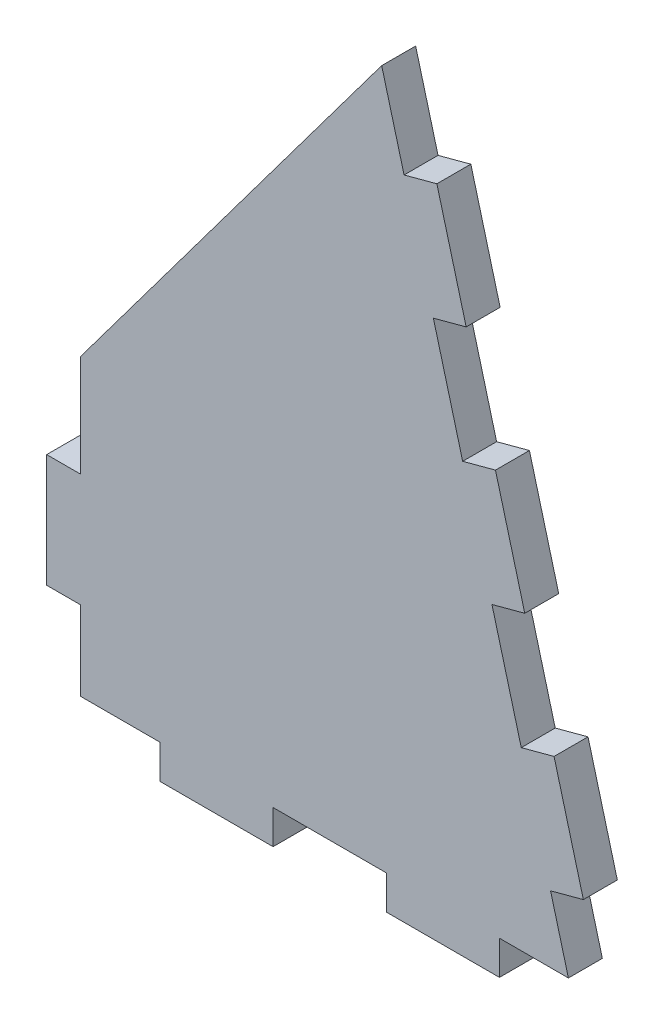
ISO-10303-21;
HEADER;
FILE_DESCRIPTION(('STEP AP214'),'2;1');
FILE_NAME('part.step','',(''),(''),'','','');
FILE_SCHEMA(('AUTOMOTIVE_DESIGN { 1 0 10303 214 1 1 1 1 }'));
ENDSEC;
DATA;
#1=APPLICATION_CONTEXT('core data for automotive mechanical design processes');
#2=APPLICATION_PROTOCOL_DEFINITION('international standard','automotive_design',2000,#1);
#3=PRODUCT_CONTEXT('',#1,'mechanical');
#4=PRODUCT('Part','Part','',(#3));
#5=PRODUCT_RELATED_PRODUCT_CATEGORY('part','',(#4));
#6=PRODUCT_DEFINITION_FORMATION('','',#4);
#7=PRODUCT_DEFINITION_CONTEXT('part definition',#1,'design');
#8=PRODUCT_DEFINITION('design','',#6,#7);
#9=PRODUCT_DEFINITION_SHAPE('','',#8);
#10=(LENGTH_UNIT() NAMED_UNIT(*) SI_UNIT(.MILLI.,.METRE.));
#11=(NAMED_UNIT(*) PLANE_ANGLE_UNIT() SI_UNIT($,.RADIAN.));
#12=(NAMED_UNIT(*) SI_UNIT($,.STERADIAN.) SOLID_ANGLE_UNIT());
#13=UNCERTAINTY_MEASURE_WITH_UNIT(LENGTH_MEASURE(1.E-05),#10,'distance_accuracy_value','');
#14=(GEOMETRIC_REPRESENTATION_CONTEXT(3) GLOBAL_UNCERTAINTY_ASSIGNED_CONTEXT((#13)) GLOBAL_UNIT_ASSIGNED_CONTEXT((#10,
#11,#12)) REPRESENTATION_CONTEXT('',''));
#15=CARTESIAN_POINT('',(0.,0.,0.));
#16=DIRECTION('',(0.,0.,1.));
#17=DIRECTION('',(1.,0.,0.));
#18=AXIS2_PLACEMENT_3D('',#15,#16,#17);
#19=CARTESIAN_POINT('',(0.,0.,-3.));
#20=DIRECTION('',(0.,-1.,0.));
#21=DIRECTION('',(0.,0.,-1.));
#22=AXIS2_PLACEMENT_3D('',#19,#20,#21);
#23=PLANE('',#22);
#24=DIRECTION('',(0.,0.,1.));
#25=VECTOR('',#24,1.);
#26=CARTESIAN_POINT('',(20.,0.,-3.));
#27=LINE('',#26,#25);
#28=CARTESIAN_POINT('',(20.,0.,-3.));
#29=VERTEX_POINT('',#28);
#30=CARTESIAN_POINT('',(20.,0.,0.));
#31=VERTEX_POINT('',#30);
#32=EDGE_CURVE('E378',#29,#31,#27,.T.);
#33=ORIENTED_EDGE('',*,*,#32,.T.);
#34=DIRECTION('',(1.,0.,0.));
#35=VECTOR('',#34,1.);
#36=CARTESIAN_POINT('',(0.,0.,0.));
#37=LINE('',#36,#35);
#38=CARTESIAN_POINT('',(10.,0.,0.));
#39=VERTEX_POINT('',#38);
#40=EDGE_CURVE('E260',#39,#31,#37,.T.);
#41=ORIENTED_EDGE('',*,*,#40,.F.);
#42=DIRECTION('',(0.,0.,1.));
#43=VECTOR('',#42,1.);
#44=CARTESIAN_POINT('',(10.,0.,-3.));
#45=LINE('',#44,#43);
#46=CARTESIAN_POINT('',(10.,0.,-3.));
#47=VERTEX_POINT('',#46);
#48=EDGE_CURVE('E405',#47,#39,#45,.T.);
#49=ORIENTED_EDGE('',*,*,#48,.F.);
#50=DIRECTION('',(1.,0.,0.));
#51=VECTOR('',#50,1.);
#52=CARTESIAN_POINT('',(0.,0.,-3.));
#53=LINE('',#52,#51);
#54=EDGE_CURVE('E240',#47,#29,#53,.T.);
#55=ORIENTED_EDGE('',*,*,#54,.T.);
#56=EDGE_LOOP('',(#33,#41,#49,#55));
#57=FACE_BOUND('',#56,.T.);
#58=ADVANCED_FACE('F32',(#57),#23,.T.);
#59=CARTESIAN_POINT('',(50.,0.,-3.));
#60=DIRECTION('',(0.965925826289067,0.258819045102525,0.));
#61=DIRECTION('',(-0.258819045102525,0.965925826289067,0.));
#62=AXIS2_PLACEMENT_3D('',#59,#60,#61);
#63=PLANE('',#62);
#64=DIRECTION('',(0.,0.,1.));
#65=VECTOR('',#64,1.);
#66=CARTESIAN_POINT('',(37.0590477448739,48.2962913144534,-3.));
#67=LINE('',#66,#65);
#68=CARTESIAN_POINT('',(37.0590477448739,48.2962913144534,-3.));
#69=VERTEX_POINT('',#68);
#70=CARTESIAN_POINT('',(37.0590477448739,48.2962913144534,0.));
#71=VERTEX_POINT('',#70);
#72=EDGE_CURVE('E308',#69,#71,#67,.T.);
#73=ORIENTED_EDGE('',*,*,#72,.F.);
#74=DIRECTION('',(-0.258819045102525,0.965925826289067,0.));
#75=VECTOR('',#74,1.);
#76=CARTESIAN_POINT('',(50.,0.,-3.));
#77=LINE('',#76,#75);
#78=CARTESIAN_POINT('',(34.4708572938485,57.955549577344,-3.));
#79=VERTEX_POINT('',#78);
#80=EDGE_CURVE('E250',#69,#79,#77,.T.);
#81=ORIENTED_EDGE('',*,*,#80,.T.);
#82=DIRECTION('',(0.,0.,1.));
#83=VECTOR('',#82,1.);
#84=CARTESIAN_POINT('',(34.4708572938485,57.955549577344,-3.));
#85=LINE('',#84,#83);
#86=CARTESIAN_POINT('',(34.4708572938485,57.955549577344,0.));
#87=VERTEX_POINT('',#86);
#88=EDGE_CURVE('E309',#79,#87,#85,.T.);
#89=ORIENTED_EDGE('',*,*,#88,.T.);
#90=DIRECTION('',(-0.258819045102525,0.965925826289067,0.));
#91=VECTOR('',#90,1.);
#92=CARTESIAN_POINT('',(50.,0.,0.));
#93=LINE('',#92,#91);
#94=EDGE_CURVE('E263',#71,#87,#93,.T.);
#95=ORIENTED_EDGE('',*,*,#94,.F.);
#96=EDGE_LOOP('',(#73,#81,#89,#95));
#97=FACE_BOUND('',#96,.T.);
#98=ADVANCED_FACE('F327',(#97),#63,.T.);
#99=DIRECTION('',(0.,0.,1.));
#100=VECTOR('',#99,1.);
#101=CARTESIAN_POINT('',(39.6472381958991,38.6370330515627,-3.));
#102=LINE('',#101,#100);
#103=CARTESIAN_POINT('',(39.6472381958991,38.6370330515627,-3.));
#104=VERTEX_POINT('',#103);
#105=CARTESIAN_POINT('',(39.6472381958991,38.6370330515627,0.));
#106=VERTEX_POINT('',#105);
#107=EDGE_CURVE('E429',#104,#106,#102,.T.);
#108=ORIENTED_EDGE('',*,*,#107,.T.);
#109=CARTESIAN_POINT('',(42.2354286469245,28.9777747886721,0.));
#110=VERTEX_POINT('',#109);
#111=EDGE_CURVE('E264',#110,#106,#93,.T.);
#112=ORIENTED_EDGE('',*,*,#111,.F.);
#113=DIRECTION('',(0.,0.,1.));
#114=VECTOR('',#113,1.);
#115=CARTESIAN_POINT('',(42.2354286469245,28.9777747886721,-3.));
#116=LINE('',#115,#114);
#117=CARTESIAN_POINT('',(42.2354286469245,28.9777747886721,-3.));
#118=VERTEX_POINT('',#117);
#119=EDGE_CURVE('E424',#118,#110,#116,.T.);
#120=ORIENTED_EDGE('',*,*,#119,.F.);
#121=EDGE_CURVE('E252',#118,#104,#77,.T.);
#122=ORIENTED_EDGE('',*,*,#121,.T.);
#123=EDGE_LOOP('',(#108,#112,#120,#122));
#124=FACE_BOUND('',#123,.T.);
#125=ADVANCED_FACE('F481',(#124),#63,.T.);
#126=CARTESIAN_POINT('',(0.,0.,-3.));
#127=DIRECTION('',(-1.,0.,0.));
#128=DIRECTION('',(0.,0.,1.));
#129=AXIS2_PLACEMENT_3D('',#126,#127,#128);
#130=PLANE('',#129);
#131=DIRECTION('',(0.,0.,1.));
#132=VECTOR('',#131,1.);
#133=CARTESIAN_POINT('',(0.,20.,-3.));
#134=LINE('',#133,#132);
#135=CARTESIAN_POINT('',(0.,20.,-3.));
#136=VERTEX_POINT('',#135);
#137=CARTESIAN_POINT('',(0.,20.,0.));
#138=VERTEX_POINT('',#137);
#139=EDGE_CURVE('E47',#136,#138,#134,.T.);
#140=ORIENTED_EDGE('',*,*,#139,.F.);
#141=DIRECTION('',(0.,-1.,0.));
#142=VECTOR('',#141,1.);
#143=CARTESIAN_POINT('',(0.,0.,-3.));
#144=LINE('',#143,#142);
#145=CARTESIAN_POINT('',(0.,10.,-3.));
#146=VERTEX_POINT('',#145);
#147=EDGE_CURVE('E228',#136,#146,#144,.T.);
#148=ORIENTED_EDGE('',*,*,#147,.T.);
#149=DIRECTION('',(0.,0.,1.));
#150=VECTOR('',#149,1.);
#151=CARTESIAN_POINT('',(0.,10.,-3.));
#152=LINE('',#151,#150);
#153=CARTESIAN_POINT('',(0.,10.,0.));
#154=VERTEX_POINT('',#153);
#155=EDGE_CURVE('E354',#146,#154,#152,.T.);
#156=ORIENTED_EDGE('',*,*,#155,.T.);
#157=DIRECTION('',(0.,-1.,0.));
#158=VECTOR('',#157,1.);
#159=CARTESIAN_POINT('',(0.,0.,0.));
#160=LINE('',#159,#158);
#161=EDGE_CURVE('E230',#138,#154,#160,.T.);
#162=ORIENTED_EDGE('',*,*,#161,.F.);
#163=EDGE_LOOP('',(#140,#148,#156,#162));
#164=FACE_BOUND('',#163,.T.);
#165=ADVANCED_FACE('F34',(#164),#130,.T.);
#166=CARTESIAN_POINT('',(31.8826668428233,67.6148078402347,-3.));
#167=DIRECTION('',(-0.800706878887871,0.599056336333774,0.));
#168=DIRECTION('',(-0.599056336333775,-0.800706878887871,0.));
#169=AXIS2_PLACEMENT_3D('',#166,#167,#168);
#170=PLANE('',#169);
#171=DIRECTION('',(0.,0.,-1.));
#172=VECTOR('',#171,1.);
#173=CARTESIAN_POINT('',(2.99999999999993,29.0098409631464,-3.));
#174=LINE('',#173,#172);
#175=CARTESIAN_POINT('',(2.99999999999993,29.0098409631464,0.));
#176=VERTEX_POINT('',#175);
#177=CARTESIAN_POINT('',(2.99999999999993,29.0098409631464,-3.));
#178=VERTEX_POINT('',#177);
#179=EDGE_CURVE('E336',#176,#178,#174,.T.);
#180=ORIENTED_EDGE('',*,*,#179,.F.);
#181=DIRECTION('',(-0.599056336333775,-0.800706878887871,0.));
#182=VECTOR('',#181,1.);
#183=CARTESIAN_POINT('',(31.8826668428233,67.6148078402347,0.));
#184=LINE('',#183,#182);
#185=CARTESIAN_POINT('',(29.5958494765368,64.558216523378,0.));
#186=VERTEX_POINT('',#185);
#187=EDGE_CURVE('E237',#186,#176,#184,.T.);
#188=ORIENTED_EDGE('',*,*,#187,.F.);
#189=DIRECTION('',(0.,0.,1.));
#190=VECTOR('',#189,1.);
#191=CARTESIAN_POINT('',(29.5958494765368,64.558216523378,-3.));
#192=LINE('',#191,#190);
#193=CARTESIAN_POINT('',(29.5958494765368,64.558216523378,-3.));
#194=VERTEX_POINT('',#193);
#195=EDGE_CURVE('E246',#194,#186,#192,.T.);
#196=ORIENTED_EDGE('',*,*,#195,.F.);
#197=DIRECTION('',(-0.599056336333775,-0.800706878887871,0.));
#198=VECTOR('',#197,1.);
#199=CARTESIAN_POINT('',(31.8826668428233,67.6148078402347,-3.));
#200=LINE('',#199,#198);
#201=EDGE_CURVE('E254',#194,#178,#200,.T.);
#202=ORIENTED_EDGE('',*,*,#201,.T.);
#203=EDGE_LOOP('',(#180,#188,#196,#202));
#204=FACE_BOUND('',#203,.T.);
#205=ADVANCED_FACE('F335',(#204),#170,.T.);
#206=DIRECTION('',(0.,0.,1.));
#207=VECTOR('',#206,1.);
#208=CARTESIAN_POINT('',(44.8236190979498,19.3185165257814,-3.));
#209=LINE('',#208,#207);
#210=CARTESIAN_POINT('',(44.8236190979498,19.3185165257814,-3.));
#211=VERTEX_POINT('',#210);
#212=CARTESIAN_POINT('',(44.8236190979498,19.3185165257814,0.));
#213=VERTEX_POINT('',#212);
#214=EDGE_CURVE('E453',#211,#213,#209,.T.);
#215=ORIENTED_EDGE('',*,*,#214,.T.);
#216=CARTESIAN_POINT('',(47.4118095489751,9.65925826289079,0.));
#217=VERTEX_POINT('',#216);
#218=EDGE_CURVE('E243',#217,#213,#93,.T.);
#219=ORIENTED_EDGE('',*,*,#218,.F.);
#220=DIRECTION('',(0.,0.,1.));
#221=VECTOR('',#220,1.);
#222=CARTESIAN_POINT('',(47.4118095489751,9.65925826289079,-3.));
#223=LINE('',#222,#221);
#224=CARTESIAN_POINT('',(47.4118095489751,9.65925826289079,-3.));
#225=VERTEX_POINT('',#224);
#226=EDGE_CURVE('E287',#225,#217,#223,.T.);
#227=ORIENTED_EDGE('',*,*,#226,.F.);
#228=EDGE_CURVE('E253',#225,#211,#77,.T.);
#229=ORIENTED_EDGE('',*,*,#228,.T.);
#230=EDGE_LOOP('',(#215,#219,#227,#229));
#231=FACE_BOUND('',#230,.T.);
#232=ADVANCED_FACE('F475',(#231),#63,.T.);
#233=DIRECTION('',(0.,0.,1.));
#234=VECTOR('',#233,1.);
#235=CARTESIAN_POINT('',(30.,0.,-3.));
#236=LINE('',#235,#234);
#237=CARTESIAN_POINT('',(30.,0.,-3.));
#238=VERTEX_POINT('',#237);
#239=CARTESIAN_POINT('',(30.,0.,0.));
#240=VERTEX_POINT('',#239);
#241=EDGE_CURVE('E369',#238,#240,#236,.T.);
#242=ORIENTED_EDGE('',*,*,#241,.F.);
#243=CARTESIAN_POINT('',(40.,0.,-3.));
#244=VERTEX_POINT('',#243);
#245=EDGE_CURVE('E236',#238,#244,#53,.T.);
#246=ORIENTED_EDGE('',*,*,#245,.T.);
#247=DIRECTION('',(0.,0.,1.));
#248=VECTOR('',#247,1.);
#249=CARTESIAN_POINT('',(40.,0.,-3.));
#250=LINE('',#249,#248);
#251=CARTESIAN_POINT('',(40.,0.,0.));
#252=VERTEX_POINT('',#251);
#253=EDGE_CURVE('E374',#244,#252,#250,.T.);
#254=ORIENTED_EDGE('',*,*,#253,.T.);
#255=EDGE_CURVE('E259',#240,#252,#37,.T.);
#256=ORIENTED_EDGE('',*,*,#255,.F.);
#257=EDGE_LOOP('',(#242,#246,#254,#256));
#258=FACE_BOUND('',#257,.T.);
#259=ADVANCED_FACE('F503',(#258),#23,.T.);
#260=CARTESIAN_POINT('',(0.,0.,-3.));
#261=DIRECTION('',(0.,0.,-1.));
#262=DIRECTION('',(-1.,0.,0.));
#263=AXIS2_PLACEMENT_3D('',#260,#261,#262);
#264=PLANE('',#263);
#265=DIRECTION('',(0.,1.,0.));
#266=VECTOR('',#265,1.);
#267=CARTESIAN_POINT('',(2.99999999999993,20.,-3.));
#268=LINE('',#267,#266);
#269=CARTESIAN_POINT('',(2.99999999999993,20.,-3.));
#270=VERTEX_POINT('',#269);
#271=EDGE_CURVE('E222',#270,#178,#268,.T.);
#272=ORIENTED_EDGE('',*,*,#271,.T.);
#273=ORIENTED_EDGE('',*,*,#201,.F.);
#274=DIRECTION('',(0.258819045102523,-0.965925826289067,0.));
#275=VECTOR('',#274,1.);
#276=CARTESIAN_POINT('',(28.9848893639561,66.8383507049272,-3.));
#277=LINE('',#276,#275);
#278=CARTESIAN_POINT('',(31.5730798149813,57.1790924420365,-3.));
#279=VERTEX_POINT('',#278);
#280=EDGE_CURVE('E298',#194,#279,#277,.T.);
#281=ORIENTED_EDGE('',*,*,#280,.T.);
#282=DIRECTION('',(0.965925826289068,0.258819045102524,0.));
#283=VECTOR('',#282,1.);
#284=CARTESIAN_POINT('',(34.4708572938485,57.955549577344,-3.));
#285=LINE('',#284,#283);
#286=EDGE_CURVE('E301',#279,#79,#285,.T.);
#287=ORIENTED_EDGE('',*,*,#286,.T.);
#288=ORIENTED_EDGE('',*,*,#80,.F.);
#289=DIRECTION('',(-0.965925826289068,-0.258819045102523,0.));
#290=VECTOR('',#289,1.);
#291=CARTESIAN_POINT('',(37.0590477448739,48.2962913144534,-3.));
#292=LINE('',#291,#290);
#293=CARTESIAN_POINT('',(34.1612702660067,47.5198341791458,-3.));
#294=VERTEX_POINT('',#293);
#295=EDGE_CURVE('E412',#69,#294,#292,.T.);
#296=ORIENTED_EDGE('',*,*,#295,.T.);
#297=DIRECTION('',(0.258819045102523,-0.965925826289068,0.));
#298=VECTOR('',#297,1.);
#299=CARTESIAN_POINT('',(34.1612702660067,47.5198341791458,-3.));
#300=LINE('',#299,#298);
#301=CARTESIAN_POINT('',(36.7494607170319,37.8605759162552,-3.));
#302=VERTEX_POINT('',#301);
#303=EDGE_CURVE('E414',#294,#302,#300,.T.);
#304=ORIENTED_EDGE('',*,*,#303,.T.);
#305=DIRECTION('',(0.965925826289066,0.258819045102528,0.));
#306=VECTOR('',#305,1.);
#307=CARTESIAN_POINT('',(39.6472381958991,38.6370330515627,-3.));
#308=LINE('',#307,#306);
#309=EDGE_CURVE('E418',#302,#104,#308,.T.);
#310=ORIENTED_EDGE('',*,*,#309,.T.);
#311=ORIENTED_EDGE('',*,*,#121,.F.);
#312=DIRECTION('',(-0.965925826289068,-0.258819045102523,0.));
#313=VECTOR('',#312,1.);
#314=CARTESIAN_POINT('',(42.2354286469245,28.9777747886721,-3.));
#315=LINE('',#314,#313);
#316=CARTESIAN_POINT('',(39.3376511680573,28.2013176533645,-3.));
#317=VERTEX_POINT('',#316);
#318=EDGE_CURVE('E436',#118,#317,#315,.T.);
#319=ORIENTED_EDGE('',*,*,#318,.T.);
#320=DIRECTION('',(0.258819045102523,-0.965925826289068,0.));
#321=VECTOR('',#320,1.);
#322=CARTESIAN_POINT('',(39.3376511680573,28.2013176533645,-3.));
#323=LINE('',#322,#321);
#324=CARTESIAN_POINT('',(41.9258416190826,18.5420593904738,-3.));
#325=VERTEX_POINT('',#324);
#326=EDGE_CURVE('E439',#317,#325,#323,.T.);
#327=ORIENTED_EDGE('',*,*,#326,.T.);
#328=DIRECTION('',(0.965925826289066,0.258819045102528,0.));
#329=VECTOR('',#328,1.);
#330=CARTESIAN_POINT('',(44.8236190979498,19.3185165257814,-3.));
#331=LINE('',#330,#329);
#332=EDGE_CURVE('E443',#325,#211,#331,.T.);
#333=ORIENTED_EDGE('',*,*,#332,.T.);
#334=ORIENTED_EDGE('',*,*,#228,.F.);
#335=DIRECTION('',(-0.965925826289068,-0.258819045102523,0.));
#336=VECTOR('',#335,1.);
#337=CARTESIAN_POINT('',(47.4118095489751,9.65925826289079,-3.));
#338=LINE('',#337,#336);
#339=CARTESIAN_POINT('',(44.514032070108,8.88280112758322,-3.));
#340=VERTEX_POINT('',#339);
#341=EDGE_CURVE('E284',#225,#340,#338,.T.);
#342=ORIENTED_EDGE('',*,*,#341,.T.);
#343=DIRECTION('',(0.258819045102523,-0.965925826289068,0.));
#344=VECTOR('',#343,1.);
#345=CARTESIAN_POINT('',(44.514032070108,8.88280112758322,-3.));
#346=LINE('',#345,#344);
#347=CARTESIAN_POINT('',(46.0903238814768,3.,-3.));
#348=VERTEX_POINT('',#347);
#349=EDGE_CURVE('E274',#340,#348,#346,.T.);
#350=ORIENTED_EDGE('',*,*,#349,.T.);
#351=DIRECTION('',(-1.,0.,0.));
#352=VECTOR('',#351,1.);
#353=CARTESIAN_POINT('',(40.,3.,-3.));
#354=LINE('',#353,#352);
#355=CARTESIAN_POINT('',(40.,3.,-3.));
#356=VERTEX_POINT('',#355);
#357=EDGE_CURVE('E282',#348,#356,#354,.T.);
#358=ORIENTED_EDGE('',*,*,#357,.T.);
#359=DIRECTION('',(0.,-1.,0.));
#360=VECTOR('',#359,1.);
#361=CARTESIAN_POINT('',(40.,0.,-3.));
#362=LINE('',#361,#360);
#363=EDGE_CURVE('E388',#356,#244,#362,.T.);
#364=ORIENTED_EDGE('',*,*,#363,.T.);
#365=ORIENTED_EDGE('',*,*,#245,.F.);
#366=DIRECTION('',(0.,1.,0.));
#367=VECTOR('',#366,1.);
#368=CARTESIAN_POINT('',(30.,0.,-3.));
#369=LINE('',#368,#367);
#370=CARTESIAN_POINT('',(30.,3.,-3.));
#371=VERTEX_POINT('',#370);
#372=EDGE_CURVE('E359',#238,#371,#369,.T.);
#373=ORIENTED_EDGE('',*,*,#372,.T.);
#374=DIRECTION('',(-1.,0.,0.));
#375=VECTOR('',#374,1.);
#376=CARTESIAN_POINT('',(20.,3.,-3.));
#377=LINE('',#376,#375);
#378=CARTESIAN_POINT('',(20.,3.,-3.));
#379=VERTEX_POINT('',#378);
#380=EDGE_CURVE('E362',#371,#379,#377,.T.);
#381=ORIENTED_EDGE('',*,*,#380,.T.);
#382=DIRECTION('',(0.,-1.,0.));
#383=VECTOR('',#382,1.);
#384=CARTESIAN_POINT('',(20.,0.,-3.));
#385=LINE('',#384,#383);
#386=EDGE_CURVE('E366',#379,#29,#385,.T.);
#387=ORIENTED_EDGE('',*,*,#386,.T.);
#388=ORIENTED_EDGE('',*,*,#54,.F.);
#389=DIRECTION('',(0.,1.,0.));
#390=VECTOR('',#389,1.);
#391=CARTESIAN_POINT('',(10.,0.,-3.));
#392=LINE('',#391,#390);
#393=CARTESIAN_POINT('',(10.,3.,-3.));
#394=VERTEX_POINT('',#393);
#395=EDGE_CURVE('E398',#47,#394,#392,.T.);
#396=ORIENTED_EDGE('',*,*,#395,.T.);
#397=DIRECTION('',(-1.,0.,0.));
#398=VECTOR('',#397,1.);
#399=CARTESIAN_POINT('',(0.,3.,-3.));
#400=LINE('',#399,#398);
#401=CARTESIAN_POINT('',(3.,3.,-3.));
#402=VERTEX_POINT('',#401);
#403=EDGE_CURVE('E401',#394,#402,#400,.T.);
#404=ORIENTED_EDGE('',*,*,#403,.T.);
#405=DIRECTION('',(0.,1.,0.));
#406=VECTOR('',#405,1.);
#407=CARTESIAN_POINT('',(3.,0.,-3.));
#408=LINE('',#407,#406);
#409=CARTESIAN_POINT('',(3.,10.,-3.));
#410=VERTEX_POINT('',#409);
#411=EDGE_CURVE('E55',#402,#410,#408,.T.);
#412=ORIENTED_EDGE('',*,*,#411,.T.);
#413=DIRECTION('',(-1.,0.,0.));
#414=VECTOR('',#413,1.);
#415=CARTESIAN_POINT('',(0.,10.,-3.));
#416=LINE('',#415,#414);
#417=EDGE_CURVE('E235',#410,#146,#416,.T.);
#418=ORIENTED_EDGE('',*,*,#417,.T.);
#419=ORIENTED_EDGE('',*,*,#147,.F.);
#420=DIRECTION('',(1.,0.,0.));
#421=VECTOR('',#420,1.);
#422=CARTESIAN_POINT('',(0.,20.,-3.));
#423=LINE('',#422,#421);
#424=EDGE_CURVE('E215',#136,#270,#423,.T.);
#425=ORIENTED_EDGE('',*,*,#424,.T.);
#426=EDGE_LOOP('',(#272,#273,#281,#287,#288,#296,#304,#310,#311,#319,#327,#333,#334,#342,#350,
#358,#364,#365,#373,#381,#387,#388,#396,#404,#412,#418,#419,#425));
#427=FACE_BOUND('',#426,.T.);
#428=ADVANCED_FACE('F233',(#427),#264,.T.);
#429=CARTESIAN_POINT('',(0.,0.,0.));
#430=DIRECTION('',(0.,0.,-1.));
#431=DIRECTION('',(-1.,0.,0.));
#432=AXIS2_PLACEMENT_3D('',#429,#430,#431);
#433=PLANE('',#432);
#434=ORIENTED_EDGE('',*,*,#187,.T.);
#435=DIRECTION('',(0.,1.,0.));
#436=VECTOR('',#435,1.);
#437=CARTESIAN_POINT('',(2.99999999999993,20.,0.));
#438=LINE('',#437,#436);
#439=CARTESIAN_POINT('',(2.99999999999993,20.,0.));
#440=VERTEX_POINT('',#439);
#441=EDGE_CURVE('E223',#440,#176,#438,.T.);
#442=ORIENTED_EDGE('',*,*,#441,.F.);
#443=DIRECTION('',(1.,0.,0.));
#444=VECTOR('',#443,1.);
#445=CARTESIAN_POINT('',(0.,20.,0.));
#446=LINE('',#445,#444);
#447=EDGE_CURVE('E338',#138,#440,#446,.T.);
#448=ORIENTED_EDGE('',*,*,#447,.F.);
#449=ORIENTED_EDGE('',*,*,#161,.T.);
#450=DIRECTION('',(-1.,0.,0.));
#451=VECTOR('',#450,1.);
#452=CARTESIAN_POINT('',(0.,10.,0.));
#453=LINE('',#452,#451);
#454=CARTESIAN_POINT('',(3.,10.,0.));
#455=VERTEX_POINT('',#454);
#456=EDGE_CURVE('E348',#455,#154,#453,.T.);
#457=ORIENTED_EDGE('',*,*,#456,.F.);
#458=DIRECTION('',(0.,1.,0.));
#459=VECTOR('',#458,1.);
#460=CARTESIAN_POINT('',(3.,0.,0.));
#461=LINE('',#460,#459);
#462=CARTESIAN_POINT('',(3.,3.,0.));
#463=VERTEX_POINT('',#462);
#464=EDGE_CURVE('E346',#463,#455,#461,.T.);
#465=ORIENTED_EDGE('',*,*,#464,.F.);
#466=DIRECTION('',(-1.,0.,0.));
#467=VECTOR('',#466,1.);
#468=CARTESIAN_POINT('',(0.,3.,0.));
#469=LINE('',#468,#467);
#470=CARTESIAN_POINT('',(10.,3.,0.));
#471=VERTEX_POINT('',#470);
#472=EDGE_CURVE('E402',#471,#463,#469,.T.);
#473=ORIENTED_EDGE('',*,*,#472,.F.);
#474=DIRECTION('',(0.,1.,0.));
#475=VECTOR('',#474,1.);
#476=CARTESIAN_POINT('',(10.,0.,0.));
#477=LINE('',#476,#475);
#478=EDGE_CURVE('E381',#39,#471,#477,.T.);
#479=ORIENTED_EDGE('',*,*,#478,.F.);
#480=ORIENTED_EDGE('',*,*,#40,.T.);
#481=DIRECTION('',(0.,-1.,0.));
#482=VECTOR('',#481,1.);
#483=CARTESIAN_POINT('',(20.,0.,0.));
#484=LINE('',#483,#482);
#485=CARTESIAN_POINT('',(20.,3.,0.));
#486=VERTEX_POINT('',#485);
#487=EDGE_CURVE('E363',#486,#31,#484,.T.);
#488=ORIENTED_EDGE('',*,*,#487,.F.);
#489=DIRECTION('',(-1.,0.,0.));
#490=VECTOR('',#489,1.);
#491=CARTESIAN_POINT('',(20.,3.,0.));
#492=LINE('',#491,#490);
#493=CARTESIAN_POINT('',(30.,3.,0.));
#494=VERTEX_POINT('',#493);
#495=EDGE_CURVE('E373',#494,#486,#492,.T.);
#496=ORIENTED_EDGE('',*,*,#495,.F.);
#497=DIRECTION('',(0.,1.,0.));
#498=VECTOR('',#497,1.);
#499=CARTESIAN_POINT('',(30.,0.,0.));
#500=LINE('',#499,#498);
#501=EDGE_CURVE('E370',#240,#494,#500,.T.);
#502=ORIENTED_EDGE('',*,*,#501,.F.);
#503=ORIENTED_EDGE('',*,*,#255,.T.);
#504=DIRECTION('',(0.,-1.,0.));
#505=VECTOR('',#504,1.);
#506=CARTESIAN_POINT('',(40.,0.,0.));
#507=LINE('',#506,#505);
#508=CARTESIAN_POINT('',(40.,3.,0.));
#509=VERTEX_POINT('',#508);
#510=EDGE_CURVE('E389',#509,#252,#507,.T.);
#511=ORIENTED_EDGE('',*,*,#510,.F.);
#512=DIRECTION('',(-1.,0.,0.));
#513=VECTOR('',#512,1.);
#514=CARTESIAN_POINT('',(40.,3.,0.));
#515=LINE('',#514,#513);
#516=CARTESIAN_POINT('',(46.0903238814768,3.,0.));
#517=VERTEX_POINT('',#516);
#518=EDGE_CURVE('E356',#517,#509,#515,.T.);
#519=ORIENTED_EDGE('',*,*,#518,.F.);
#520=DIRECTION('',(0.258819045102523,-0.965925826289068,0.));
#521=VECTOR('',#520,1.);
#522=CARTESIAN_POINT('',(44.514032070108,8.88280112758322,0.));
#523=LINE('',#522,#521);
#524=CARTESIAN_POINT('',(44.514032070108,8.88280112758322,0.));
#525=VERTEX_POINT('',#524);
#526=EDGE_CURVE('E277',#525,#517,#523,.T.);
#527=ORIENTED_EDGE('',*,*,#526,.F.);
#528=DIRECTION('',(-0.965925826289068,-0.258819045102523,0.));
#529=VECTOR('',#528,1.);
#530=CARTESIAN_POINT('',(47.4118095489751,9.65925826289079,0.));
#531=LINE('',#530,#529);
#532=EDGE_CURVE('E292',#217,#525,#531,.T.);
#533=ORIENTED_EDGE('',*,*,#532,.F.);
#534=ORIENTED_EDGE('',*,*,#218,.T.);
#535=DIRECTION('',(0.965925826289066,0.258819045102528,0.));
#536=VECTOR('',#535,1.);
#537=CARTESIAN_POINT('',(44.8236190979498,19.3185165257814,0.));
#538=LINE('',#537,#536);
#539=CARTESIAN_POINT('',(41.9258416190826,18.5420593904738,0.));
#540=VERTEX_POINT('',#539);
#541=EDGE_CURVE('E440',#540,#213,#538,.T.);
#542=ORIENTED_EDGE('',*,*,#541,.F.);
#543=DIRECTION('',(0.258819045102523,-0.965925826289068,0.));
#544=VECTOR('',#543,1.);
#545=CARTESIAN_POINT('',(39.3376511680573,28.2013176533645,0.));
#546=LINE('',#545,#544);
#547=CARTESIAN_POINT('',(39.3376511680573,28.2013176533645,0.));
#548=VERTEX_POINT('',#547);
#549=EDGE_CURVE('E448',#548,#540,#546,.T.);
#550=ORIENTED_EDGE('',*,*,#549,.F.);
#551=DIRECTION('',(-0.965925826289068,-0.258819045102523,0.));
#552=VECTOR('',#551,1.);
#553=CARTESIAN_POINT('',(42.2354286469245,28.9777747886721,0.));
#554=LINE('',#553,#552);
#555=EDGE_CURVE('E296',#110,#548,#554,.T.);
#556=ORIENTED_EDGE('',*,*,#555,.F.);
#557=ORIENTED_EDGE('',*,*,#111,.T.);
#558=DIRECTION('',(0.965925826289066,0.258819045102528,0.));
#559=VECTOR('',#558,1.);
#560=CARTESIAN_POINT('',(39.6472381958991,38.6370330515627,0.));
#561=LINE('',#560,#559);
#562=CARTESIAN_POINT('',(36.7494607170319,37.8605759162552,0.));
#563=VERTEX_POINT('',#562);
#564=EDGE_CURVE('E415',#563,#106,#561,.T.);
#565=ORIENTED_EDGE('',*,*,#564,.F.);
#566=DIRECTION('',(0.258819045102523,-0.965925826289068,0.));
#567=VECTOR('',#566,1.);
#568=CARTESIAN_POINT('',(34.1612702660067,47.5198341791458,0.));
#569=LINE('',#568,#567);
#570=CARTESIAN_POINT('',(34.1612702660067,47.5198341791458,0.));
#571=VERTEX_POINT('',#570);
#572=EDGE_CURVE('E423',#571,#563,#569,.T.);
#573=ORIENTED_EDGE('',*,*,#572,.F.);
#574=DIRECTION('',(-0.965925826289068,-0.258819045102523,0.));
#575=VECTOR('',#574,1.);
#576=CARTESIAN_POINT('',(37.0590477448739,48.2962913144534,0.));
#577=LINE('',#576,#575);
#578=EDGE_CURVE('E324',#71,#571,#577,.T.);
#579=ORIENTED_EDGE('',*,*,#578,.F.);
#580=ORIENTED_EDGE('',*,*,#94,.T.);
#581=DIRECTION('',(0.965925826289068,0.258819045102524,0.));
#582=VECTOR('',#581,1.);
#583=CARTESIAN_POINT('',(34.4708572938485,57.955549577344,0.));
#584=LINE('',#583,#582);
#585=CARTESIAN_POINT('',(31.5730798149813,57.1790924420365,0.));
#586=VERTEX_POINT('',#585);
#587=EDGE_CURVE('E302',#586,#87,#584,.T.);
#588=ORIENTED_EDGE('',*,*,#587,.F.);
#589=DIRECTION('',(-0.258819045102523,0.965925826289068,0.));
#590=VECTOR('',#589,1.);
#591=CARTESIAN_POINT('',(43.7528576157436,11.7235428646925,0.));
#592=LINE('',#591,#590);
#593=EDGE_CURVE('E257',#586,#186,#592,.T.);
#594=ORIENTED_EDGE('',*,*,#593,.T.);
#595=EDGE_LOOP('',(#434,#442,#448,#449,#457,#465,#473,#479,#480,#488,#496,#502,#503,#511,#519,
#527,#533,#534,#542,#550,#556,#557,#565,#573,#579,#580,#588,#594));
#596=FACE_BOUND('',#595,.T.);
#597=ADVANCED_FACE('F319',(#596),#433,.F.);
#598=CARTESIAN_POINT('',(34.4708572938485,57.955549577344,-3.));
#599=DIRECTION('',(0.258819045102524,-0.965925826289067,0.));
#600=DIRECTION('',(0.965925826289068,0.258819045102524,0.));
#601=AXIS2_PLACEMENT_3D('',#598,#599,#600);
#602=PLANE('',#601);
#603=ORIENTED_EDGE('',*,*,#587,.T.);
#604=ORIENTED_EDGE('',*,*,#88,.F.);
#605=ORIENTED_EDGE('',*,*,#286,.F.);
#606=DIRECTION('',(0.,0.,1.));
#607=VECTOR('',#606,1.);
#608=CARTESIAN_POINT('',(31.5730798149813,57.1790924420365,-3.));
#609=LINE('',#608,#607);
#610=EDGE_CURVE('E305',#279,#586,#609,.T.);
#611=ORIENTED_EDGE('',*,*,#610,.T.);
#612=EDGE_LOOP('',(#603,#604,#605,#611));
#613=FACE_BOUND('',#612,.T.);
#614=ADVANCED_FACE('F315',(#613),#602,.F.);
#615=CARTESIAN_POINT('',(28.9848893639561,66.8383507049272,-3.));
#616=DIRECTION('',(-0.965925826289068,-0.258819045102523,0.));
#617=DIRECTION('',(0.258819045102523,-0.965925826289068,0.));
#618=AXIS2_PLACEMENT_3D('',#615,#616,#617);
#619=PLANE('',#618);
#620=ORIENTED_EDGE('',*,*,#195,.T.);
#621=ORIENTED_EDGE('',*,*,#593,.F.);
#622=ORIENTED_EDGE('',*,*,#610,.F.);
#623=ORIENTED_EDGE('',*,*,#280,.F.);
#624=EDGE_LOOP('',(#620,#621,#622,#623));
#625=FACE_BOUND('',#624,.T.);
#626=ADVANCED_FACE('F332',(#625),#619,.F.);
#627=CARTESIAN_POINT('',(47.4118095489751,9.65925826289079,-3.));
#628=DIRECTION('',(-0.258819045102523,0.965925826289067,0.));
#629=DIRECTION('',(-0.965925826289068,-0.258819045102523,0.));
#630=AXIS2_PLACEMENT_3D('',#627,#628,#629);
#631=PLANE('',#630);
#632=ORIENTED_EDGE('',*,*,#532,.T.);
#633=DIRECTION('',(0.,0.,1.));
#634=VECTOR('',#633,1.);
#635=CARTESIAN_POINT('',(44.514032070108,8.88280112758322,-3.));
#636=LINE('',#635,#634);
#637=EDGE_CURVE('E285',#340,#525,#636,.T.);
#638=ORIENTED_EDGE('',*,*,#637,.F.);
#639=ORIENTED_EDGE('',*,*,#341,.F.);
#640=ORIENTED_EDGE('',*,*,#226,.T.);
#641=EDGE_LOOP('',(#632,#638,#639,#640));
#642=FACE_BOUND('',#641,.T.);
#643=ADVANCED_FACE('F688',(#642),#631,.F.);
#644=CARTESIAN_POINT('',(44.514032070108,8.88280112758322,-3.));
#645=DIRECTION('',(-0.965925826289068,-0.258819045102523,0.));
#646=DIRECTION('',(0.258819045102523,-0.965925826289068,0.));
#647=AXIS2_PLACEMENT_3D('',#644,#645,#646);
#648=PLANE('',#647);
#649=ORIENTED_EDGE('',*,*,#526,.T.);
#650=DIRECTION('',(0.,0.,-1.));
#651=VECTOR('',#650,1.);
#652=CARTESIAN_POINT('',(46.0903238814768,3.,-3.));
#653=LINE('',#652,#651);
#654=EDGE_CURVE('E40',#517,#348,#653,.T.);
#655=ORIENTED_EDGE('',*,*,#654,.T.);
#656=ORIENTED_EDGE('',*,*,#349,.F.);
#657=ORIENTED_EDGE('',*,*,#637,.T.);
#658=EDGE_LOOP('',(#649,#655,#656,#657));
#659=FACE_BOUND('',#658,.T.);
#660=ADVANCED_FACE('F272',(#659),#648,.F.);
#661=CARTESIAN_POINT('',(42.2354286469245,28.9777747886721,-3.));
#662=DIRECTION('',(-0.258819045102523,0.965925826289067,0.));
#663=DIRECTION('',(-0.965925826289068,-0.258819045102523,0.));
#664=AXIS2_PLACEMENT_3D('',#661,#662,#663);
#665=PLANE('',#664);
#666=ORIENTED_EDGE('',*,*,#555,.T.);
#667=DIRECTION('',(0.,0.,1.));
#668=VECTOR('',#667,1.);
#669=CARTESIAN_POINT('',(39.3376511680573,28.2013176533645,-3.));
#670=LINE('',#669,#668);
#671=EDGE_CURVE('E446',#317,#548,#670,.T.);
#672=ORIENTED_EDGE('',*,*,#671,.F.);
#673=ORIENTED_EDGE('',*,*,#318,.F.);
#674=ORIENTED_EDGE('',*,*,#119,.T.);
#675=EDGE_LOOP('',(#666,#672,#673,#674));
#676=FACE_BOUND('',#675,.T.);
#677=ADVANCED_FACE('F674',(#676),#665,.F.);
#678=CARTESIAN_POINT('',(44.8236190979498,19.3185165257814,-3.));
#679=DIRECTION('',(0.258819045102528,-0.965925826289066,0.));
#680=DIRECTION('',(0.965925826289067,0.258819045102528,0.));
#681=AXIS2_PLACEMENT_3D('',#678,#679,#680);
#682=PLANE('',#681);
#683=ORIENTED_EDGE('',*,*,#541,.T.);
#684=ORIENTED_EDGE('',*,*,#214,.F.);
#685=ORIENTED_EDGE('',*,*,#332,.F.);
#686=DIRECTION('',(0.,0.,1.));
#687=VECTOR('',#686,1.);
#688=CARTESIAN_POINT('',(41.9258416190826,18.5420593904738,-3.));
#689=LINE('',#688,#687);
#690=EDGE_CURVE('E456',#325,#540,#689,.T.);
#691=ORIENTED_EDGE('',*,*,#690,.T.);
#692=EDGE_LOOP('',(#683,#684,#685,#691));
#693=FACE_BOUND('',#692,.T.);
#694=ADVANCED_FACE('F471',(#693),#682,.F.);
#695=CARTESIAN_POINT('',(39.3376511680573,28.2013176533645,-3.));
#696=DIRECTION('',(-0.965925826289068,-0.258819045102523,0.));
#697=DIRECTION('',(0.258819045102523,-0.965925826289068,0.));
#698=AXIS2_PLACEMENT_3D('',#695,#696,#697);
#699=PLANE('',#698);
#700=ORIENTED_EDGE('',*,*,#549,.T.);
#701=ORIENTED_EDGE('',*,*,#690,.F.);
#702=ORIENTED_EDGE('',*,*,#326,.F.);
#703=ORIENTED_EDGE('',*,*,#671,.T.);
#704=EDGE_LOOP('',(#700,#701,#702,#703));
#705=FACE_BOUND('',#704,.T.);
#706=ADVANCED_FACE('F461',(#705),#699,.F.);
#707=CARTESIAN_POINT('',(37.0590477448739,48.2962913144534,-3.));
#708=DIRECTION('',(-0.258819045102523,0.965925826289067,0.));
#709=DIRECTION('',(-0.965925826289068,-0.258819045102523,0.));
#710=AXIS2_PLACEMENT_3D('',#707,#708,#709);
#711=PLANE('',#710);
#712=ORIENTED_EDGE('',*,*,#578,.T.);
#713=DIRECTION('',(0.,0.,1.));
#714=VECTOR('',#713,1.);
#715=CARTESIAN_POINT('',(34.1612702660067,47.5198341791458,-3.));
#716=LINE('',#715,#714);
#717=EDGE_CURVE('E421',#294,#571,#716,.T.);
#718=ORIENTED_EDGE('',*,*,#717,.F.);
#719=ORIENTED_EDGE('',*,*,#295,.F.);
#720=ORIENTED_EDGE('',*,*,#72,.T.);
#721=EDGE_LOOP('',(#712,#718,#719,#720));
#722=FACE_BOUND('',#721,.T.);
#723=ADVANCED_FACE('F490',(#722),#711,.F.);
#724=CARTESIAN_POINT('',(39.6472381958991,38.6370330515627,-3.));
#725=DIRECTION('',(0.258819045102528,-0.965925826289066,0.));
#726=DIRECTION('',(0.965925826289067,0.258819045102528,0.));
#727=AXIS2_PLACEMENT_3D('',#724,#725,#726);
#728=PLANE('',#727);
#729=ORIENTED_EDGE('',*,*,#564,.T.);
#730=ORIENTED_EDGE('',*,*,#107,.F.);
#731=ORIENTED_EDGE('',*,*,#309,.F.);
#732=DIRECTION('',(0.,0.,1.));
#733=VECTOR('',#732,1.);
#734=CARTESIAN_POINT('',(36.7494607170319,37.8605759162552,-3.));
#735=LINE('',#734,#733);
#736=EDGE_CURVE('E432',#302,#563,#735,.T.);
#737=ORIENTED_EDGE('',*,*,#736,.T.);
#738=EDGE_LOOP('',(#729,#730,#731,#737));
#739=FACE_BOUND('',#738,.T.);
#740=ADVANCED_FACE('F485',(#739),#728,.F.);
#741=CARTESIAN_POINT('',(34.1612702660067,47.5198341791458,-3.));
#742=DIRECTION('',(-0.965925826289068,-0.258819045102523,0.));
#743=DIRECTION('',(0.258819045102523,-0.965925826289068,0.));
#744=AXIS2_PLACEMENT_3D('',#741,#742,#743);
#745=PLANE('',#744);
#746=ORIENTED_EDGE('',*,*,#572,.T.);
#747=ORIENTED_EDGE('',*,*,#736,.F.);
#748=ORIENTED_EDGE('',*,*,#303,.F.);
#749=ORIENTED_EDGE('',*,*,#717,.T.);
#750=EDGE_LOOP('',(#746,#747,#748,#749));
#751=FACE_BOUND('',#750,.T.);
#752=ADVANCED_FACE('F488',(#751),#745,.F.);
#753=CARTESIAN_POINT('',(0.,3.,-3.));
#754=DIRECTION('',(0.,1.,0.));
#755=DIRECTION('',(0.,0.,1.));
#756=AXIS2_PLACEMENT_3D('',#753,#754,#755);
#757=PLANE('',#756);
#758=ORIENTED_EDGE('',*,*,#472,.T.);
#759=DIRECTION('',(0.,0.,-1.));
#760=VECTOR('',#759,1.);
#761=CARTESIAN_POINT('',(3.,3.,-3.));
#762=LINE('',#761,#760);
#763=EDGE_CURVE('E11',#463,#402,#762,.T.);
#764=ORIENTED_EDGE('',*,*,#763,.T.);
#765=ORIENTED_EDGE('',*,*,#403,.F.);
#766=DIRECTION('',(0.,0.,1.));
#767=VECTOR('',#766,1.);
#768=CARTESIAN_POINT('',(10.,3.,-3.));
#769=LINE('',#768,#767);
#770=EDGE_CURVE('E294',#394,#471,#769,.T.);
#771=ORIENTED_EDGE('',*,*,#770,.T.);
#772=EDGE_LOOP('',(#758,#764,#765,#771));
#773=FACE_BOUND('',#772,.T.);
#774=ADVANCED_FACE('F543',(#773),#757,.F.);
#775=CARTESIAN_POINT('',(10.,0.,-3.));
#776=DIRECTION('',(1.,0.,0.));
#777=DIRECTION('',(0.,1.,0.));
#778=AXIS2_PLACEMENT_3D('',#775,#776,#777);
#779=PLANE('',#778);
#780=ORIENTED_EDGE('',*,*,#478,.T.);
#781=ORIENTED_EDGE('',*,*,#770,.F.);
#782=ORIENTED_EDGE('',*,*,#395,.F.);
#783=ORIENTED_EDGE('',*,*,#48,.T.);
#784=EDGE_LOOP('',(#780,#781,#782,#783));
#785=FACE_BOUND('',#784,.T.);
#786=ADVANCED_FACE('F538',(#785),#779,.F.);
#787=CARTESIAN_POINT('',(40.,3.,-3.));
#788=DIRECTION('',(0.,1.,0.));
#789=DIRECTION('',(0.,0.,1.));
#790=AXIS2_PLACEMENT_3D('',#787,#788,#789);
#791=PLANE('',#790);
#792=ORIENTED_EDGE('',*,*,#518,.T.);
#793=DIRECTION('',(0.,0.,1.));
#794=VECTOR('',#793,1.);
#795=CARTESIAN_POINT('',(40.,3.,-3.));
#796=LINE('',#795,#794);
#797=EDGE_CURVE('E391',#356,#509,#796,.T.);
#798=ORIENTED_EDGE('',*,*,#797,.F.);
#799=ORIENTED_EDGE('',*,*,#357,.F.);
#800=ORIENTED_EDGE('',*,*,#654,.F.);
#801=EDGE_LOOP('',(#792,#798,#799,#800));
#802=FACE_BOUND('',#801,.T.);
#803=ADVANCED_FACE('F568',(#802),#791,.F.);
#804=CARTESIAN_POINT('',(40.,0.,-3.));
#805=DIRECTION('',(-1.,0.,0.));
#806=DIRECTION('',(0.,0.,1.));
#807=AXIS2_PLACEMENT_3D('',#804,#805,#806);
#808=PLANE('',#807);
#809=ORIENTED_EDGE('',*,*,#510,.T.);
#810=ORIENTED_EDGE('',*,*,#253,.F.);
#811=ORIENTED_EDGE('',*,*,#363,.F.);
#812=ORIENTED_EDGE('',*,*,#797,.T.);
#813=EDGE_LOOP('',(#809,#810,#811,#812));
#814=FACE_BOUND('',#813,.T.);
#815=ADVANCED_FACE('F523',(#814),#808,.F.);
#816=CARTESIAN_POINT('',(20.,0.,-3.));
#817=DIRECTION('',(-1.,0.,0.));
#818=DIRECTION('',(0.,-1.,0.));
#819=AXIS2_PLACEMENT_3D('',#816,#817,#818);
#820=PLANE('',#819);
#821=ORIENTED_EDGE('',*,*,#487,.T.);
#822=ORIENTED_EDGE('',*,*,#32,.F.);
#823=ORIENTED_EDGE('',*,*,#386,.F.);
#824=DIRECTION('',(0.,0.,1.));
#825=VECTOR('',#824,1.);
#826=CARTESIAN_POINT('',(20.,3.,-3.));
#827=LINE('',#826,#825);
#828=EDGE_CURVE('E382',#379,#486,#827,.T.);
#829=ORIENTED_EDGE('',*,*,#828,.T.);
#830=EDGE_LOOP('',(#821,#822,#823,#829));
#831=FACE_BOUND('',#830,.T.);
#832=ADVANCED_FACE('F559',(#831),#820,.F.);
#833=CARTESIAN_POINT('',(20.,3.,-3.));
#834=DIRECTION('',(0.,1.,0.));
#835=DIRECTION('',(0.,0.,1.));
#836=AXIS2_PLACEMENT_3D('',#833,#834,#835);
#837=PLANE('',#836);
#838=ORIENTED_EDGE('',*,*,#495,.T.);
#839=ORIENTED_EDGE('',*,*,#828,.F.);
#840=ORIENTED_EDGE('',*,*,#380,.F.);
#841=DIRECTION('',(0.,0.,1.));
#842=VECTOR('',#841,1.);
#843=CARTESIAN_POINT('',(30.,3.,-3.));
#844=LINE('',#843,#842);
#845=EDGE_CURVE('E384',#371,#494,#844,.T.);
#846=ORIENTED_EDGE('',*,*,#845,.T.);
#847=EDGE_LOOP('',(#838,#839,#840,#846));
#848=FACE_BOUND('',#847,.T.);
#849=ADVANCED_FACE('F530',(#848),#837,.F.);
#850=CARTESIAN_POINT('',(30.,0.,-3.));
#851=DIRECTION('',(1.,0.,0.));
#852=DIRECTION('',(0.,1.,0.));
#853=AXIS2_PLACEMENT_3D('',#850,#851,#852);
#854=PLANE('',#853);
#855=ORIENTED_EDGE('',*,*,#501,.T.);
#856=ORIENTED_EDGE('',*,*,#845,.F.);
#857=ORIENTED_EDGE('',*,*,#372,.F.);
#858=ORIENTED_EDGE('',*,*,#241,.T.);
#859=EDGE_LOOP('',(#855,#856,#857,#858));
#860=FACE_BOUND('',#859,.T.);
#861=ADVANCED_FACE('F527',(#860),#854,.F.);
#862=CARTESIAN_POINT('',(3.,0.,-3.));
#863=DIRECTION('',(1.,0.,0.));
#864=DIRECTION('',(0.,1.,0.));
#865=AXIS2_PLACEMENT_3D('',#862,#863,#864);
#866=PLANE('',#865);
#867=ORIENTED_EDGE('',*,*,#464,.T.);
#868=DIRECTION('',(0.,0.,1.));
#869=VECTOR('',#868,1.);
#870=CARTESIAN_POINT('',(3.,10.,-3.));
#871=LINE('',#870,#869);
#872=EDGE_CURVE('E350',#410,#455,#871,.T.);
#873=ORIENTED_EDGE('',*,*,#872,.F.);
#874=ORIENTED_EDGE('',*,*,#411,.F.);
#875=ORIENTED_EDGE('',*,*,#763,.F.);
#876=EDGE_LOOP('',(#867,#873,#874,#875));
#877=FACE_BOUND('',#876,.T.);
#878=ADVANCED_FACE('F545',(#877),#866,.F.);
#879=CARTESIAN_POINT('',(0.,10.,-3.));
#880=DIRECTION('',(0.,1.,0.));
#881=DIRECTION('',(0.,0.,1.));
#882=AXIS2_PLACEMENT_3D('',#879,#880,#881);
#883=PLANE('',#882);
#884=ORIENTED_EDGE('',*,*,#456,.T.);
#885=ORIENTED_EDGE('',*,*,#155,.F.);
#886=ORIENTED_EDGE('',*,*,#417,.F.);
#887=ORIENTED_EDGE('',*,*,#872,.T.);
#888=EDGE_LOOP('',(#884,#885,#886,#887));
#889=FACE_BOUND('',#888,.T.);
#890=ADVANCED_FACE('F547',(#889),#883,.F.);
#891=CARTESIAN_POINT('',(2.99999999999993,20.,-3.));
#892=DIRECTION('',(1.,0.,0.));
#893=DIRECTION('',(0.,1.,0.));
#894=AXIS2_PLACEMENT_3D('',#891,#892,#893);
#895=PLANE('',#894);
#896=ORIENTED_EDGE('',*,*,#179,.T.);
#897=ORIENTED_EDGE('',*,*,#271,.F.);
#898=DIRECTION('',(0.,0.,1.));
#899=VECTOR('',#898,1.);
#900=CARTESIAN_POINT('',(2.99999999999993,20.,-3.));
#901=LINE('',#900,#899);
#902=EDGE_CURVE('E217',#270,#440,#901,.T.);
#903=ORIENTED_EDGE('',*,*,#902,.T.);
#904=ORIENTED_EDGE('',*,*,#441,.T.);
#905=EDGE_LOOP('',(#896,#897,#903,#904));
#906=FACE_BOUND('',#905,.T.);
#907=ADVANCED_FACE('F549',(#906),#895,.F.);
#908=CARTESIAN_POINT('',(0.,20.,-3.));
#909=DIRECTION('',(0.,-1.,0.));
#910=DIRECTION('',(0.,0.,-1.));
#911=AXIS2_PLACEMENT_3D('',#908,#909,#910);
#912=PLANE('',#911);
#913=ORIENTED_EDGE('',*,*,#447,.T.);
#914=ORIENTED_EDGE('',*,*,#902,.F.);
#915=ORIENTED_EDGE('',*,*,#424,.F.);
#916=ORIENTED_EDGE('',*,*,#139,.T.);
#917=EDGE_LOOP('',(#913,#914,#915,#916));
#918=FACE_BOUND('',#917,.T.);
#919=ADVANCED_FACE('F216',(#918),#912,.F.);
#920=CLOSED_SHELL('',(#58,#98,#125,#165,#205,#232,#259,#428,#597,#614,#626,#643,#660,#677,#694,
#706,#723,#740,#752,#774,#786,#803,#815,#832,#849,#861,#878,#890,#907,#919));
#921=MANIFOLD_SOLID_BREP('B2',#920);
#922=ADVANCED_BREP_SHAPE_REPRESENTATION('',(#18,#921),#14);
#923=SHAPE_DEFINITION_REPRESENTATION(#9,#922);
ENDSEC;
END-ISO-10303-21;
